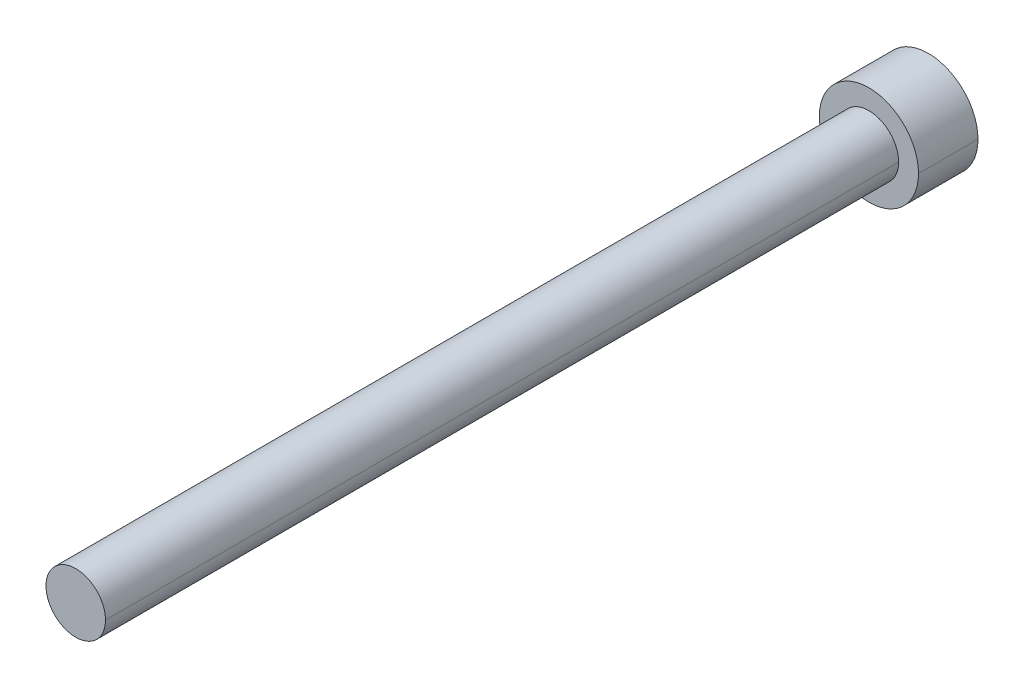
ISO-10303-21;
HEADER;
FILE_DESCRIPTION(('STEP AP214'),'2;1');
FILE_NAME('part.step','',(''),(''),'','','');
FILE_SCHEMA(('AUTOMOTIVE_DESIGN { 1 0 10303 214 1 1 1 1 }'));
ENDSEC;
DATA;
#1=APPLICATION_CONTEXT('core data for automotive mechanical design processes');
#2=APPLICATION_PROTOCOL_DEFINITION('international standard','automotive_design',2000,#1);
#3=PRODUCT_CONTEXT('',#1,'mechanical');
#4=PRODUCT('Part','Part','',(#3));
#5=PRODUCT_RELATED_PRODUCT_CATEGORY('part','',(#4));
#6=PRODUCT_DEFINITION_FORMATION('','',#4);
#7=PRODUCT_DEFINITION_CONTEXT('part definition',#1,'design');
#8=PRODUCT_DEFINITION('design','',#6,#7);
#9=PRODUCT_DEFINITION_SHAPE('','',#8);
#10=(LENGTH_UNIT() NAMED_UNIT(*) SI_UNIT(.MILLI.,.METRE.));
#11=(NAMED_UNIT(*) PLANE_ANGLE_UNIT() SI_UNIT($,.RADIAN.));
#12=(NAMED_UNIT(*) SI_UNIT($,.STERADIAN.) SOLID_ANGLE_UNIT());
#13=UNCERTAINTY_MEASURE_WITH_UNIT(LENGTH_MEASURE(1.E-05),#10,'distance_accuracy_value','');
#14=(GEOMETRIC_REPRESENTATION_CONTEXT(3) GLOBAL_UNCERTAINTY_ASSIGNED_CONTEXT((#13)) GLOBAL_UNIT_ASSIGNED_CONTEXT((#10,
#11,#12)) REPRESENTATION_CONTEXT('',''));
#15=CARTESIAN_POINT('',(0.,0.,0.));
#16=DIRECTION('',(0.,0.,1.));
#17=DIRECTION('',(1.,0.,0.));
#18=AXIS2_PLACEMENT_3D('',#15,#16,#17);
#19=CARTESIAN_POINT('',(0.,0.,3.));
#20=DIRECTION('',(0.,0.,-1.));
#21=DIRECTION('',(0.,1.,0.));
#22=AXIS2_PLACEMENT_3D('',#19,#20,#21);
#23=CYLINDRICAL_SURFACE('',#22,2.5);
#24=CARTESIAN_POINT('',(-2.5,0.,3.));
#25=CARTESIAN_POINT('',(-2.49981497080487,-0.45541626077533,3.));
#26=CARTESIAN_POINT('',(-2.37591735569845,-0.90151492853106,3.));
#27=CARTESIAN_POINT('',(-1.91279547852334,-1.66890510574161,3.));
#28=CARTESIAN_POINT('',(-1.5890876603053,-1.97958715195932,3.));
#29=CARTESIAN_POINT('',(-0.67572357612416,-2.48099772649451,3.));
#30=CARTESIAN_POINT('',(-0.0618687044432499,-2.57056963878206,3.));
#31=CARTESIAN_POINT('',(0.8983983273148,-2.36398703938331,3.));
#32=CARTESIAN_POINT('',(1.24739549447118,-2.19977085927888,3.));
#33=CARTESIAN_POINT('',(2.04566561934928,-1.57105434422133,3.));
#34=CARTESIAN_POINT('',(2.37639245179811,-1.00326581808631,3.));
#35=CARTESIAN_POINT('',(2.49049494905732,-0.250937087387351,3.));
#36=CARTESIAN_POINT('',(2.49994898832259,-0.12555611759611,3.));
#37=CARTESIAN_POINT('',(2.5,0.,3.));
#38=B_SPLINE_CURVE_WITH_KNOTS('',3,(#24,#25,#26,#27,#28,#29,#30,#31,#32,#33,#34,#35,#36,#37),
.UNSPECIFIED.,.F.,.F.,(4,2,2,2,2,2,4),(0.,0.172601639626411,0.339653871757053,0.567466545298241,
0.711758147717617,0.952421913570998,1.),.UNSPECIFIED.);
#39=CARTESIAN_POINT('',(-2.5,0.,3.));
#40=VERTEX_POINT('',#39);
#41=CARTESIAN_POINT('',(2.5,0.,3.));
#42=VERTEX_POINT('',#41);
#43=EDGE_CURVE('E11',#40,#42,#38,.T.);
#44=ORIENTED_EDGE('',*,*,#43,.F.);
#45=CARTESIAN_POINT('',(-2.5,0.,3.));
#46=DIRECTION('',(0.,0.,-1.));
#47=VECTOR('',#46,1.);
#48=LINE('',#45,#47);
#49=CARTESIAN_POINT('',(-2.5,0.,0.));
#50=VERTEX_POINT('',#49);
#51=EDGE_CURVE('E25',#40,#50,#48,.T.);
#52=ORIENTED_EDGE('',*,*,#51,.T.);
#53=CARTESIAN_POINT('',(0.,0.,0.));
#54=DIRECTION('',(0.,0.,1.));
#55=DIRECTION('',(-1.,0.,0.));
#56=AXIS2_PLACEMENT_3D('',#53,#54,#55);
#57=CIRCLE('',#56,2.5);
#58=CARTESIAN_POINT('',(2.5,0.,0.));
#59=VERTEX_POINT('',#58);
#60=EDGE_CURVE('E144',#50,#59,#57,.T.);
#61=ORIENTED_EDGE('',*,*,#60,.T.);
#62=CARTESIAN_POINT('',(2.5,0.,0.));
#63=DIRECTION('',(0.,0.,1.));
#64=VECTOR('',#63,1.);
#65=LINE('',#62,#64);
#66=EDGE_CURVE('E138',#59,#42,#65,.T.);
#67=ORIENTED_EDGE('',*,*,#66,.T.);
#68=EDGE_LOOP('',(#44,#52,#61,#67));
#69=FACE_BOUND('',#68,.T.);
#70=ADVANCED_FACE('F16',(#69),#23,.T.);
#71=CARTESIAN_POINT('',(0.,0.,3.));
#72=DIRECTION('',(0.,0.,-1.));
#73=DIRECTION('',(0.,-1.,0.));
#74=AXIS2_PLACEMENT_3D('',#71,#72,#73);
#75=CYLINDRICAL_SURFACE('',#74,2.5);
#76=CARTESIAN_POINT('',(0.,0.,0.));
#77=DIRECTION('',(0.,0.,1.));
#78=DIRECTION('',(1.,0.,0.));
#79=AXIS2_PLACEMENT_3D('',#76,#77,#78);
#80=CIRCLE('',#79,2.5);
#81=EDGE_CURVE('E134',#59,#50,#80,.T.);
#82=ORIENTED_EDGE('',*,*,#81,.T.);
#83=ORIENTED_EDGE('',*,*,#51,.F.);
#84=CARTESIAN_POINT('',(2.5,0.,3.));
#85=CARTESIAN_POINT('',(2.49981497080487,0.45541626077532,3.));
#86=CARTESIAN_POINT('',(2.37591735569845,0.90151492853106,3.));
#87=CARTESIAN_POINT('',(1.91279547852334,1.6689051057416,3.));
#88=CARTESIAN_POINT('',(1.58908766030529,1.97958715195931,3.));
#89=CARTESIAN_POINT('',(0.67572357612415,2.48099772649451,3.));
#90=CARTESIAN_POINT('',(0.0618687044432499,2.57056963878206,3.));
#91=CARTESIAN_POINT('',(-0.89839832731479,2.36398703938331,3.));
#92=CARTESIAN_POINT('',(-1.2473954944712,2.19977085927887,3.));
#93=CARTESIAN_POINT('',(-2.04566561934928,1.57105434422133,3.));
#94=CARTESIAN_POINT('',(-2.37639245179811,1.0032658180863,3.));
#95=CARTESIAN_POINT('',(-2.49049494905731,0.25093708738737,3.));
#96=CARTESIAN_POINT('',(-2.49994898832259,0.12555611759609,3.));
#97=CARTESIAN_POINT('',(-2.5,0.,3.));
#98=B_SPLINE_CURVE_WITH_KNOTS('',3,(#84,#85,#86,#87,#88,#89,#90,#91,#92,#93,#94,#95,#96,#97),
.UNSPECIFIED.,.F.,.F.,(4,2,2,2,2,2,4),(0.,0.172601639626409,0.339653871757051,0.567466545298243,
0.711758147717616,0.952421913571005,1.),.UNSPECIFIED.);
#99=EDGE_CURVE('E132',#42,#40,#98,.T.);
#100=ORIENTED_EDGE('',*,*,#99,.F.);
#101=ORIENTED_EDGE('',*,*,#66,.F.);
#102=EDGE_LOOP('',(#82,#83,#100,#101));
#103=FACE_BOUND('',#102,.T.);
#104=ADVANCED_FACE('F151',(#103),#75,.T.);
#105=CARTESIAN_POINT('',(-2.5,-2.57056963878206,3.));
#106=DIRECTION('',(0.,0.,1.));
#107=DIRECTION('',(1.,0.,0.));
#108=AXIS2_PLACEMENT_3D('',#105,#106,#107);
#109=PLANE('',#108);
#110=ORIENTED_EDGE('',*,*,#99,.T.);
#111=ORIENTED_EDGE('',*,*,#43,.T.);
#112=EDGE_LOOP('',(#110,#111));
#113=FACE_BOUND('',#112,.T.);
#114=CARTESIAN_POINT('',(0.,0.,3.));
#115=DIRECTION('',(0.,0.,1.));
#116=DIRECTION('',(-1.,0.,0.));
#117=AXIS2_PLACEMENT_3D('',#114,#115,#116);
#118=CIRCLE('',#117,1.5);
#119=CARTESIAN_POINT('',(-1.5,0.,3.));
#120=VERTEX_POINT('',#119);
#121=CARTESIAN_POINT('',(1.5,0.,3.));
#122=VERTEX_POINT('',#121);
#123=EDGE_CURVE('E75',#120,#122,#118,.T.);
#124=ORIENTED_EDGE('',*,*,#123,.F.);
#125=CARTESIAN_POINT('',(0.,0.,3.));
#126=DIRECTION('',(0.,0.,1.));
#127=DIRECTION('',(1.,0.,0.));
#128=AXIS2_PLACEMENT_3D('',#125,#126,#127);
#129=CIRCLE('',#128,1.5);
#130=EDGE_CURVE('E130',#122,#120,#129,.T.);
#131=ORIENTED_EDGE('',*,*,#130,.F.);
#132=EDGE_LOOP('',(#124,#131));
#133=FACE_BOUND('',#132,.T.);
#134=ADVANCED_FACE('F180',(#113,#133),#109,.T.);
#135=CARTESIAN_POINT('',(0.,0.,43.));
#136=DIRECTION('',(0.,0.,-1.));
#137=DIRECTION('',(0.,-1.,0.));
#138=AXIS2_PLACEMENT_3D('',#135,#136,#137);
#139=CYLINDRICAL_SURFACE('',#138,1.5);
#140=ORIENTED_EDGE('',*,*,#130,.T.);
#141=CARTESIAN_POINT('',(-1.5,0.,43.));
#142=DIRECTION('',(0.,0.,-1.));
#143=VECTOR('',#142,1.);
#144=LINE('',#141,#143);
#145=CARTESIAN_POINT('',(-1.5,0.,43.));
#146=VERTEX_POINT('',#145);
#147=EDGE_CURVE('E62',#146,#120,#144,.T.);
#148=ORIENTED_EDGE('',*,*,#147,.F.);
#149=CARTESIAN_POINT('',(1.5,0.,43.));
#150=CARTESIAN_POINT('',(1.49988898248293,0.27324975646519,43.));
#151=CARTESIAN_POINT('',(1.42555041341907,0.54090895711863,43.));
#152=CARTESIAN_POINT('',(1.147677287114,1.00134306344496,43.));
#153=CARTESIAN_POINT('',(0.95345259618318,1.18775229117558,43.));
#154=CARTESIAN_POINT('',(0.40543414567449,1.4885986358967,43.));
#155=CARTESIAN_POINT('',(0.0371212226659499,1.54234178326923,43.));
#156=CARTESIAN_POINT('',(-0.539038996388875,1.41839222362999,43.));
#157=CARTESIAN_POINT('',(-0.748437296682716,1.31986251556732,43.));
#158=CARTESIAN_POINT('',(-1.22739937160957,0.9426326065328,43.));
#159=CARTESIAN_POINT('',(-1.42583547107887,0.60195949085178,43.));
#160=CARTESIAN_POINT('',(-1.49429696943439,0.15056225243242,43.));
#161=CARTESIAN_POINT('',(-1.49996939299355,0.0753336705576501,43.));
#162=CARTESIAN_POINT('',(-1.5,0.,43.));
#163=B_SPLINE_CURVE_WITH_KNOTS('',3,(#149,#150,#151,#152,#153,#154,#155,#156,#157,#158,#159,
#160,#161,#162),.UNSPECIFIED.,.F.,.F.,(4,2,2,2,2,2,4),(0.,0.17260163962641,0.339653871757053,
0.567466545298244,0.711758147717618,0.952421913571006,1.),.UNSPECIFIED.);
#164=CARTESIAN_POINT('',(1.5,0.,43.));
#165=VERTEX_POINT('',#164);
#166=EDGE_CURVE('E53',#165,#146,#163,.T.);
#167=ORIENTED_EDGE('',*,*,#166,.F.);
#168=CARTESIAN_POINT('',(1.5,0.,3.));
#169=DIRECTION('',(0.,0.,1.));
#170=VECTOR('',#169,1.);
#171=LINE('',#168,#170);
#172=EDGE_CURVE('E58',#122,#165,#171,.T.);
#173=ORIENTED_EDGE('',*,*,#172,.F.);
#174=EDGE_LOOP('',(#140,#148,#167,#173));
#175=FACE_BOUND('',#174,.T.);
#176=ADVANCED_FACE('F57',(#175),#139,.T.);
#177=CARTESIAN_POINT('',(0.,0.,43.));
#178=DIRECTION('',(0.,0.,-1.));
#179=DIRECTION('',(0.,1.,0.));
#180=AXIS2_PLACEMENT_3D('',#177,#178,#179);
#181=CYLINDRICAL_SURFACE('',#180,1.5);
#182=CARTESIAN_POINT('',(-1.5,0.,43.));
#183=CARTESIAN_POINT('',(-1.49988898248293,-0.2732497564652,43.));
#184=CARTESIAN_POINT('',(-1.42555041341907,-0.54090895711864,43.));
#185=CARTESIAN_POINT('',(-1.147677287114,-1.00134306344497,43.));
#186=CARTESIAN_POINT('',(-0.953452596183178,-1.18775229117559,43.));
#187=CARTESIAN_POINT('',(-0.40543414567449,-1.48859863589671,43.));
#188=CARTESIAN_POINT('',(-0.0371212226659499,-1.54234178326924,43.));
#189=CARTESIAN_POINT('',(0.53903899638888,-1.41839222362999,43.));
#190=CARTESIAN_POINT('',(0.74843729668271,-1.31986251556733,43.));
#191=CARTESIAN_POINT('',(1.22739937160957,-0.942632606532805,43.));
#192=CARTESIAN_POINT('',(1.42583547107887,-0.601959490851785,43.));
#193=CARTESIAN_POINT('',(1.49429696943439,-0.15056225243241,43.));
#194=CARTESIAN_POINT('',(1.49996939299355,-0.0753336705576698,43.));
#195=CARTESIAN_POINT('',(1.5,0.,43.));
#196=B_SPLINE_CURVE_WITH_KNOTS('',3,(#182,#183,#184,#185,#186,#187,#188,#189,#190,#191,#192,
#193,#194,#195),.UNSPECIFIED.,.F.,.F.,(4,2,2,2,2,2,4),(0.,0.172601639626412,0.339653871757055,
0.567466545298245,0.711758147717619,0.952421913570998,1.),.UNSPECIFIED.);
#197=EDGE_CURVE('E73',#146,#165,#196,.T.);
#198=ORIENTED_EDGE('',*,*,#197,.F.);
#199=ORIENTED_EDGE('',*,*,#147,.T.);
#200=ORIENTED_EDGE('',*,*,#123,.T.);
#201=ORIENTED_EDGE('',*,*,#172,.T.);
#202=EDGE_LOOP('',(#198,#199,#200,#201));
#203=FACE_BOUND('',#202,.T.);
#204=ADVANCED_FACE('F72',(#203),#181,.T.);
#205=CARTESIAN_POINT('',(-1.5,-1.54234178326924,43.));
#206=DIRECTION('',(0.,0.,1.));
#207=DIRECTION('',(1.,0.,0.));
#208=AXIS2_PLACEMENT_3D('',#205,#206,#207);
#209=PLANE('',#208);
#210=ORIENTED_EDGE('',*,*,#166,.T.);
#211=ORIENTED_EDGE('',*,*,#197,.T.);
#212=EDGE_LOOP('',(#210,#211));
#213=FACE_BOUND('',#212,.T.);
#214=ADVANCED_FACE('F80',(#213),#209,.T.);
#215=CARTESIAN_POINT('',(-2.5,-2.57056963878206,0.));
#216=DIRECTION('',(0.,0.,-1.));
#217=DIRECTION('',(0.,1.,0.));
#218=AXIS2_PLACEMENT_3D('',#215,#216,#217);
#219=PLANE('',#218);
#220=ORIENTED_EDGE('',*,*,#60,.F.);
#221=ORIENTED_EDGE('',*,*,#81,.F.);
#222=EDGE_LOOP('',(#220,#221));
#223=FACE_BOUND('',#222,.T.);
#224=ADVANCED_FACE('F98',(#223),#219,.T.);
#225=CLOSED_SHELL('',(#70,#104,#134,#176,#204,#214,#224));
#226=MANIFOLD_SOLID_BREP('B1',#225);
#227=ADVANCED_BREP_SHAPE_REPRESENTATION('',(#18,#226),#14);
#228=SHAPE_DEFINITION_REPRESENTATION(#9,#227);
ENDSEC;
END-ISO-10303-21;
